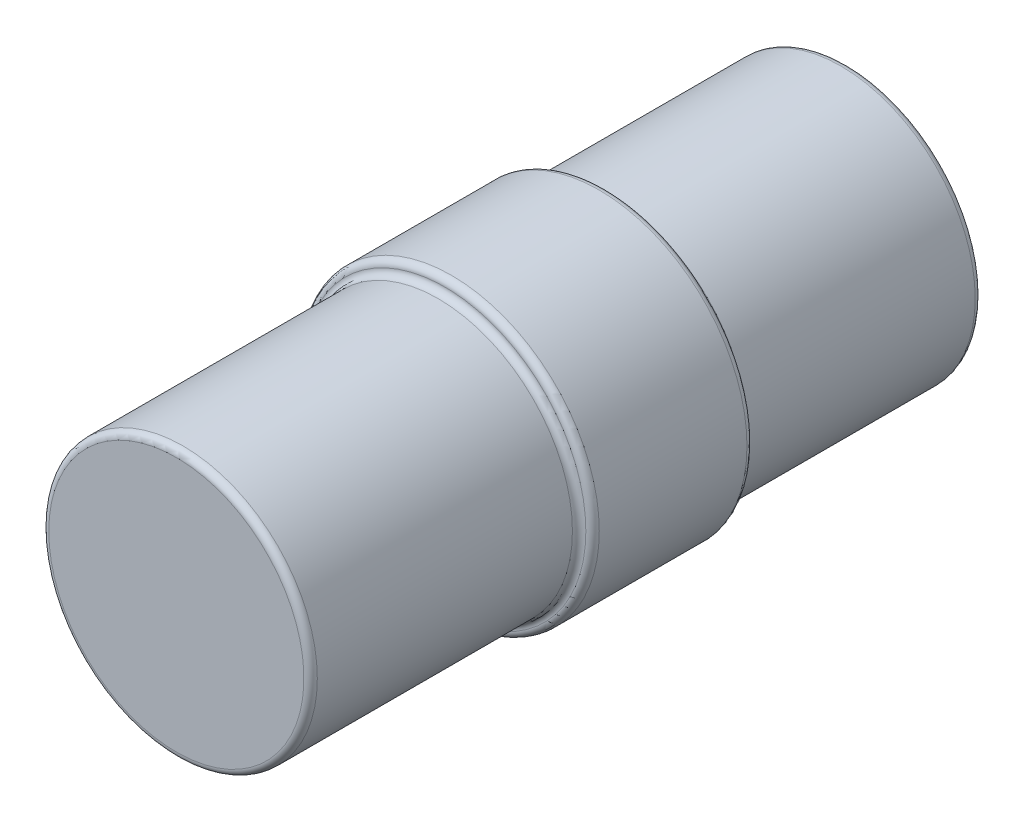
ISO-10303-21;
HEADER;
FILE_DESCRIPTION(('STEP AP214'),'2;1');
FILE_NAME('part.step','',(''),(''),'','','');
FILE_SCHEMA(('AUTOMOTIVE_DESIGN { 1 0 10303 214 1 1 1 1 }'));
ENDSEC;
DATA;
#1=APPLICATION_CONTEXT('core data for automotive mechanical design processes');
#2=APPLICATION_PROTOCOL_DEFINITION('international standard','automotive_design',2000,#1);
#3=PRODUCT_CONTEXT('',#1,'mechanical');
#4=PRODUCT('Part','Part','',(#3));
#5=PRODUCT_RELATED_PRODUCT_CATEGORY('part','',(#4));
#6=PRODUCT_DEFINITION_FORMATION('','',#4);
#7=PRODUCT_DEFINITION_CONTEXT('part definition',#1,'design');
#8=PRODUCT_DEFINITION('design','',#6,#7);
#9=PRODUCT_DEFINITION_SHAPE('','',#8);
#10=(LENGTH_UNIT() NAMED_UNIT(*) SI_UNIT(.MILLI.,.METRE.));
#11=(NAMED_UNIT(*) PLANE_ANGLE_UNIT() SI_UNIT($,.RADIAN.));
#12=(NAMED_UNIT(*) SI_UNIT($,.STERADIAN.) SOLID_ANGLE_UNIT());
#13=UNCERTAINTY_MEASURE_WITH_UNIT(LENGTH_MEASURE(1.E-05),#10,'distance_accuracy_value','');
#14=(GEOMETRIC_REPRESENTATION_CONTEXT(3) GLOBAL_UNCERTAINTY_ASSIGNED_CONTEXT((#13)) GLOBAL_UNIT_ASSIGNED_CONTEXT((#10,
#11,#12)) REPRESENTATION_CONTEXT('',''));
#15=CARTESIAN_POINT('',(0.,0.,0.));
#16=DIRECTION('',(0.,0.,1.));
#17=DIRECTION('',(1.,0.,0.));
#18=AXIS2_PLACEMENT_3D('',#15,#16,#17);
#19=CARTESIAN_POINT('',(0.,10.,0.));
#20=DIRECTION('',(0.,0.,-1.));
#21=DIRECTION('',(-1.,0.,0.));
#22=AXIS2_PLACEMENT_3D('',#19,#20,#21);
#23=PLANE('',#22);
#24=CARTESIAN_POINT('',(0.,0.,0.));
#25=DIRECTION('',(0.,0.,-1.));
#26=DIRECTION('',(-1.,0.,0.));
#27=AXIS2_PLACEMENT_3D('',#24,#25,#26);
#28=CIRCLE('',#27,9.5);
#29=CARTESIAN_POINT('',(-9.5,0.,0.));
#30=VERTEX_POINT('',#29);
#31=EDGE_CURVE('E10',#30,#30,#28,.F.);
#32=ORIENTED_EDGE('',*,*,#31,.T.);
#33=EDGE_LOOP('',(#32));
#34=FACE_BOUND('',#33,.T.);
#35=ADVANCED_FACE('F29',(#34),#23,.F.);
#36=CARTESIAN_POINT('',(0.,0.,-50.));
#37=DIRECTION('',(0.,0.,1.));
#38=DIRECTION('',(1.,0.,0.));
#39=AXIS2_PLACEMENT_3D('',#36,#37,#38);
#40=PLANE('',#39);
#41=CARTESIAN_POINT('',(0.,0.,-50.));
#42=DIRECTION('',(0.,0.,1.));
#43=DIRECTION('',(1.,0.,0.));
#44=AXIS2_PLACEMENT_3D('',#41,#42,#43);
#45=CIRCLE('',#44,9.5);
#46=CARTESIAN_POINT('',(9.5,0.,-50.));
#47=VERTEX_POINT('',#46);
#48=EDGE_CURVE('E101',#47,#47,#45,.F.);
#49=ORIENTED_EDGE('',*,*,#48,.T.);
#50=EDGE_LOOP('',(#49));
#51=FACE_BOUND('',#50,.T.);
#52=ADVANCED_FACE('F73',(#51),#40,.F.);
#53=CARTESIAN_POINT('',(0.,0.,0.));
#54=DIRECTION('',(0.,0.,1.));
#55=DIRECTION('',(1.,0.,0.));
#56=AXIS2_PLACEMENT_3D('',#53,#54,#55);
#57=CYLINDRICAL_SURFACE('',#56,10.);
#58=CARTESIAN_POINT('',(0.,0.,-49.5));
#59=DIRECTION('',(0.,0.,1.));
#60=DIRECTION('',(1.,0.,0.));
#61=AXIS2_PLACEMENT_3D('',#58,#59,#60);
#62=CIRCLE('',#61,10.);
#63=CARTESIAN_POINT('',(10.,0.,-49.5));
#64=VERTEX_POINT('',#63);
#65=EDGE_CURVE('E51',#64,#64,#62,.T.);
#66=ORIENTED_EDGE('',*,*,#65,.T.);
#67=EDGE_LOOP('',(#66));
#68=FACE_BOUND('',#67,.T.);
#69=CARTESIAN_POINT('',(0.,0.,-32.5));
#70=DIRECTION('',(0.,0.,1.));
#71=DIRECTION('',(1.,0.,0.));
#72=AXIS2_PLACEMENT_3D('',#69,#70,#71);
#73=CIRCLE('',#72,10.);
#74=CARTESIAN_POINT('',(10.,0.,-32.5));
#75=VERTEX_POINT('',#74);
#76=EDGE_CURVE('E47',#75,#75,#73,.F.);
#77=ORIENTED_EDGE('',*,*,#76,.T.);
#78=EDGE_LOOP('',(#77));
#79=FACE_BOUND('',#78,.T.);
#80=ADVANCED_FACE('F78',(#68,#79),#57,.T.);
#81=CARTESIAN_POINT('',(0.,0.,0.));
#82=DIRECTION('',(0.,0.,1.));
#83=DIRECTION('',(1.,0.,0.));
#84=AXIS2_PLACEMENT_3D('',#81,#82,#83);
#85=CYLINDRICAL_SURFACE('',#84,11.);
#86=CARTESIAN_POINT('',(0.,0.,-31.5));
#87=DIRECTION('',(0.,0.,1.));
#88=DIRECTION('',(1.,0.,0.));
#89=AXIS2_PLACEMENT_3D('',#86,#87,#88);
#90=CIRCLE('',#89,11.);
#91=CARTESIAN_POINT('',(11.,0.,-31.5));
#92=VERTEX_POINT('',#91);
#93=EDGE_CURVE('E95',#92,#92,#90,.T.);
#94=ORIENTED_EDGE('',*,*,#93,.T.);
#95=EDGE_LOOP('',(#94));
#96=FACE_BOUND('',#95,.T.);
#97=CARTESIAN_POINT('',(0.,0.,-20.5));
#98=DIRECTION('',(0.,0.,-1.));
#99=DIRECTION('',(-1.,0.,0.));
#100=AXIS2_PLACEMENT_3D('',#97,#98,#99);
#101=CIRCLE('',#100,11.);
#102=CARTESIAN_POINT('',(-11.,0.,-20.5));
#103=VERTEX_POINT('',#102);
#104=EDGE_CURVE('E97',#103,#103,#101,.T.);
#105=ORIENTED_EDGE('',*,*,#104,.T.);
#106=EDGE_LOOP('',(#105));
#107=FACE_BOUND('',#106,.T.);
#108=ADVANCED_FACE('F112',(#96,#107),#85,.T.);
#109=CARTESIAN_POINT('',(0.,0.,0.));
#110=DIRECTION('',(0.,0.,1.));
#111=DIRECTION('',(1.,0.,0.));
#112=AXIS2_PLACEMENT_3D('',#109,#110,#111);
#113=CYLINDRICAL_SURFACE('',#112,10.);
#114=CARTESIAN_POINT('',(0.,0.,-19.5));
#115=DIRECTION('',(0.,0.,-1.));
#116=DIRECTION('',(-1.,0.,0.));
#117=AXIS2_PLACEMENT_3D('',#114,#115,#116);
#118=CIRCLE('',#117,10.);
#119=CARTESIAN_POINT('',(-10.,0.,-19.5));
#120=VERTEX_POINT('',#119);
#121=EDGE_CURVE('E37',#120,#120,#118,.F.);
#122=ORIENTED_EDGE('',*,*,#121,.T.);
#123=EDGE_LOOP('',(#122));
#124=FACE_BOUND('',#123,.T.);
#125=CARTESIAN_POINT('',(0.,0.,-0.5));
#126=DIRECTION('',(0.,0.,-1.));
#127=DIRECTION('',(-1.,0.,0.));
#128=AXIS2_PLACEMENT_3D('',#125,#126,#127);
#129=CIRCLE('',#128,10.);
#130=CARTESIAN_POINT('',(-10.,0.,-0.5));
#131=VERTEX_POINT('',#130);
#132=EDGE_CURVE('E42',#131,#131,#129,.T.);
#133=ORIENTED_EDGE('',*,*,#132,.T.);
#134=EDGE_LOOP('',(#133));
#135=FACE_BOUND('',#134,.T.);
#136=ADVANCED_FACE('F85',(#124,#135),#113,.T.);
#137=CARTESIAN_POINT('',(0.,0.,-49.5));
#138=DIRECTION('',(0.,0.,1.));
#139=DIRECTION('',(1.,0.,0.));
#140=AXIS2_PLACEMENT_3D('',#137,#138,#139);
#141=TOROIDAL_SURFACE('',#140,9.5,0.5);
#142=ORIENTED_EDGE('',*,*,#48,.F.);
#143=EDGE_LOOP('',(#142));
#144=FACE_BOUND('',#143,.T.);
#145=ORIENTED_EDGE('',*,*,#65,.F.);
#146=EDGE_LOOP('',(#145));
#147=FACE_BOUND('',#146,.T.);
#148=ADVANCED_FACE('F83',(#144,#147),#141,.T.);
#149=CARTESIAN_POINT('',(0.,0.,-31.5));
#150=DIRECTION('',(0.,0.,1.));
#151=DIRECTION('',(1.,0.,0.));
#152=AXIS2_PLACEMENT_3D('',#149,#150,#151);
#153=TOROIDAL_SURFACE('',#152,10.5,0.5);
#154=ORIENTED_EDGE('',*,*,#93,.F.);
#155=EDGE_LOOP('',(#154));
#156=FACE_BOUND('',#155,.T.);
#157=CARTESIAN_POINT('',(0.,0.,-32.));
#158=DIRECTION('',(0.,0.,1.));
#159=DIRECTION('',(1.,0.,0.));
#160=AXIS2_PLACEMENT_3D('',#157,#158,#159);
#161=CIRCLE('',#160,10.5);
#162=CARTESIAN_POINT('',(10.5,0.,-32.));
#163=VERTEX_POINT('',#162);
#164=EDGE_CURVE('E45',#163,#163,#161,.F.);
#165=ORIENTED_EDGE('',*,*,#164,.F.);
#166=EDGE_LOOP('',(#165));
#167=FACE_BOUND('',#166,.T.);
#168=ADVANCED_FACE('F68',(#156,#167),#153,.T.);
#169=CARTESIAN_POINT('',(0.,0.,-32.5));
#170=DIRECTION('',(0.,0.,1.));
#171=DIRECTION('',(1.,0.,0.));
#172=AXIS2_PLACEMENT_3D('',#169,#170,#171);
#173=TOROIDAL_SURFACE('',#172,10.5,0.5);
#174=ORIENTED_EDGE('',*,*,#76,.F.);
#175=EDGE_LOOP('',(#174));
#176=FACE_BOUND('',#175,.T.);
#177=ORIENTED_EDGE('',*,*,#164,.T.);
#178=EDGE_LOOP('',(#177));
#179=FACE_BOUND('',#178,.T.);
#180=ADVANCED_FACE('F60',(#176,#179),#173,.F.);
#181=CARTESIAN_POINT('',(0.,0.,-19.5));
#182=DIRECTION('',(0.,0.,-1.));
#183=DIRECTION('',(-1.,0.,0.));
#184=AXIS2_PLACEMENT_3D('',#181,#182,#183);
#185=TOROIDAL_SURFACE('',#184,10.5,0.5);
#186=ORIENTED_EDGE('',*,*,#121,.F.);
#187=EDGE_LOOP('',(#186));
#188=FACE_BOUND('',#187,.T.);
#189=CARTESIAN_POINT('',(0.,0.,-20.));
#190=DIRECTION('',(0.,0.,-1.));
#191=DIRECTION('',(-1.,0.,0.));
#192=AXIS2_PLACEMENT_3D('',#189,#190,#191);
#193=CIRCLE('',#192,10.5);
#194=CARTESIAN_POINT('',(-10.5,0.,-20.));
#195=VERTEX_POINT('',#194);
#196=EDGE_CURVE('E33',#195,#195,#193,.T.);
#197=ORIENTED_EDGE('',*,*,#196,.F.);
#198=EDGE_LOOP('',(#197));
#199=FACE_BOUND('',#198,.T.);
#200=ADVANCED_FACE('F58',(#188,#199),#185,.F.);
#201=CARTESIAN_POINT('',(0.,0.,-20.5));
#202=DIRECTION('',(0.,0.,-1.));
#203=DIRECTION('',(-1.,0.,0.));
#204=AXIS2_PLACEMENT_3D('',#201,#202,#203);
#205=TOROIDAL_SURFACE('',#204,10.5,0.5);
#206=ORIENTED_EDGE('',*,*,#104,.F.);
#207=EDGE_LOOP('',(#206));
#208=FACE_BOUND('',#207,.T.);
#209=ORIENTED_EDGE('',*,*,#196,.T.);
#210=EDGE_LOOP('',(#209));
#211=FACE_BOUND('',#210,.T.);
#212=ADVANCED_FACE('F56',(#208,#211),#205,.T.);
#213=CARTESIAN_POINT('',(0.,0.,-0.5));
#214=DIRECTION('',(0.,0.,-1.));
#215=DIRECTION('',(-1.,0.,0.));
#216=AXIS2_PLACEMENT_3D('',#213,#214,#215);
#217=TOROIDAL_SURFACE('',#216,9.5,0.5);
#218=ORIENTED_EDGE('',*,*,#132,.F.);
#219=EDGE_LOOP('',(#218));
#220=FACE_BOUND('',#219,.T.);
#221=ORIENTED_EDGE('',*,*,#31,.F.);
#222=EDGE_LOOP('',(#221));
#223=FACE_BOUND('',#222,.T.);
#224=ADVANCED_FACE('F31',(#220,#223),#217,.T.);
#225=CLOSED_SHELL('',(#35,#52,#80,#108,#136,#148,#168,#180,#200,#212,#224));
#226=MANIFOLD_SOLID_BREP('B2',#225);
#227=ADVANCED_BREP_SHAPE_REPRESENTATION('',(#18,#226),#14);
#228=SHAPE_DEFINITION_REPRESENTATION(#9,#227);
ENDSEC;
END-ISO-10303-21;
